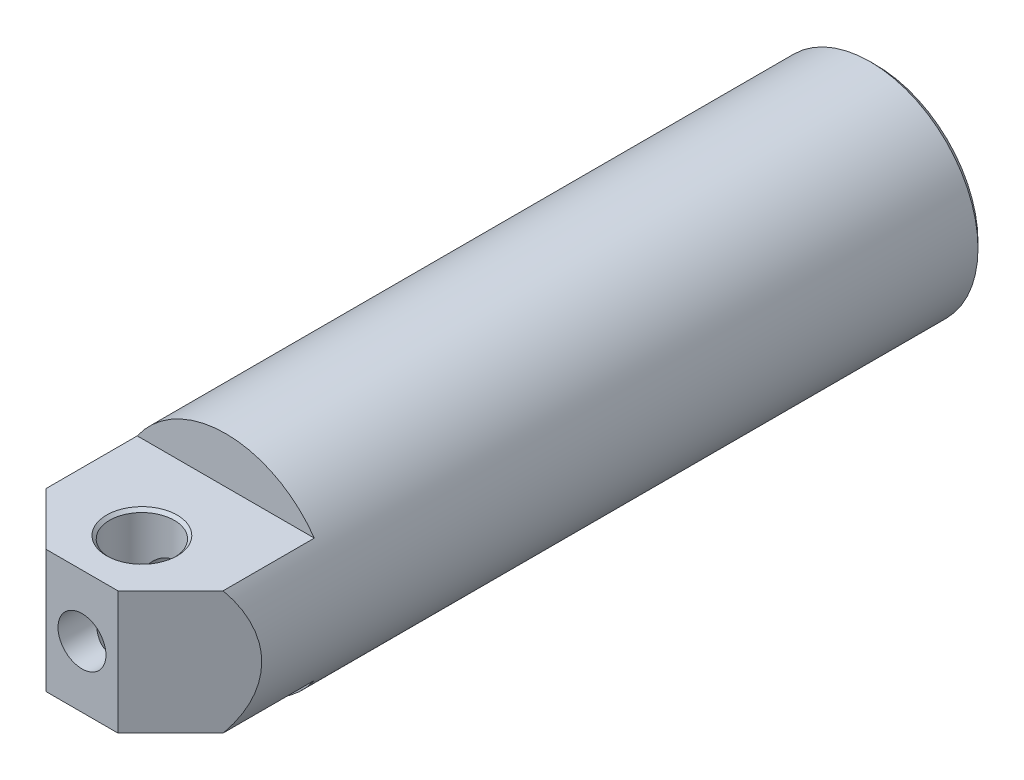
from build123d import *

# Parameters (mm, degrees)
SKETCH2_OUTSIDE_W   = 104.224
SKETCH2_OUTSIDE_H   = 104.224
SKETCH2_OUTSIDE_W_2 = 57.15
SKETCH2_OUTSIDE_H_2 = 32.645999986
CUT_EXTRUDE1_DEPTH  = 38.1
SKETCH3_R           = 8.563500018
CUT_EXTRUDE2_DEPTH  = 218.002307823
CUT_EXTRUDE3_DEPTH  = 218.002307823
CUT_EXTRUDE4_DEPTH  = 215.221151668
CHAMFER1_SIZE       = 1.5875
CHAMFER2_SIZE       = 1.5875
CHAMFER2_SIZE2      = 0.916543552
CHAMFER3_SIZE       = 0.79375
SKETCH6_R           = 6.35
CUT_EXTRUDE5_DEPTH  = 215.221151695
CHAMFER4_SIZE       = 1.5875


with BuildPart() as part:
    # Sketch1 → Revolve1 (revolve)
    with BuildSketch(Plane(origin=(0, 0, 0), x_dir=(0, 0, -1), z_dir=(1, 0, 0)), mode=Mode.PRIVATE) as revolve1_sk:
        Polygon((108.774999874, 22.225), (199.758299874, 22.225), (199.758299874, 22.9489), (200.786999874, 22.9489), (200.786999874, 22.225), (204.786999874, 22.225), (204.786999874, 23.5966), (206.564999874, 23.5966), (206.564999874, 22.225), (210.374999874, 22.225), (210.374999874, 28.575), (0, 28.575), (0, 0), (38.726802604, 0), (44.45, 9.525), (44.45, 19.05), (108.774999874, 19.05), align=None)
    revolve(revolve1_sk.sketch.rotate(Axis((0, 0, 0), (0, 0, -1)), 90), axis=Axis((0, 0, 0), (0, 0, -1)))

    # Sketch2 outside → Cut-Extrude1 (cut)
    with BuildSketch(Plane.XY):
        Rectangle(SKETCH2_OUTSIDE_W, SKETCH2_OUTSIDE_H)
        Rectangle(SKETCH2_OUTSIDE_W_2, SKETCH2_OUTSIDE_H_2, mode=Mode.SUBTRACT)
    extrude(amount=-CUT_EXTRUDE1_DEPTH, mode=Mode.SUBTRACT)

    # Sketch3 → Cut-Extrude2 (cut, through all)
    with BuildSketch(Plane(origin=(0, 16.322999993, 0), x_dir=(1, 0, 0), z_dir=(0, 1, 0))):
        with Locations(Location((0, 15.875, 0), (0, 0, 270))):
            Circle(SKETCH3_R)
    extrude(amount=-CUT_EXTRUDE2_DEPTH, mode=Mode.SUBTRACT)

    # Sketch4 → Cut-Extrude3 (cut, through all)
    with BuildSketch(Plane(origin=(0, 16.322999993, 0), x_dir=(1, 0, 0), z_dir=(0, 1, 0))):
        Polygon((-28.575, 0), (-9.525, 0), (-28.575, 19.05), align=None)
        Polygon((28.575, 19.05), (28.575, 0), (9.525, 0), align=None)
    extrude(amount=-CUT_EXTRUDE3_DEPTH, mode=Mode.SUBTRACT)

    # Sketch5 → Cut-Extrude4 (cut, through all)
    with BuildSketch(Plane(origin=(0, 0, 0), x_dir=(1, 0, 0), z_dir=(0, 1, 0))):
        with BuildLine():
            Line((-4.063500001, 121.474999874), (-4.063500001, 169.099999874))
            ThreePointArc((-4.063500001, 169.099999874), (0, 173.163499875), (4.063500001, 169.099999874))
            Line((4.063500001, 169.099999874), (4.063500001, 121.474999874))
            ThreePointArc((4.063500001, 121.474999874), (0, 117.411499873), (-4.063500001, 121.474999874))
        make_face()
    extrude(amount=-CUT_EXTRUDE4_DEPTH, mode=Mode.SUBTRACT)

    # Chamfer1
    chamfer1_edges = [part.edges().sort_by_distance(p)[0] for p in [
        (-28.575, 0, -210.374999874),
    ]]
    chamfer(chamfer1_edges, length=CHAMFER1_SIZE)

    # Chamfer2
    chamfer2_edges = [part.edges().sort_by_distance(p)[0] for p in [
        (-19.05, 0, -108.774999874),
    ]]
    chamfer2_side = [part.faces().sort_by_distance(p)[0] for p in [
        (-19.05, 0, -76.612499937),
    ]]
    chamfer(chamfer2_edges, length=CHAMFER2_SIZE, length2=CHAMFER2_SIZE2, reference=chamfer2_side[0])

    # Chamfer3
    chamfer3_edges = [part.edges().sort_by_distance(p)[0] for p in [
        (0, -16.322999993, -24.438500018),
        (0, 16.322999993, -24.438500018),
    ]]
    chamfer(chamfer3_edges, length=CHAMFER3_SIZE)

    # Sketch6 → Cut-Extrude5 (cut, through all)
    with BuildSketch(Plane.XY):
        Circle(SKETCH6_R)
    extrude(amount=-CUT_EXTRUDE5_DEPTH, mode=Mode.SUBTRACT)

    # Chamfer4
    chamfer4_edges = [part.edges().sort_by_distance(p)[0] for p in [
        (-22.225, 0, -210.374999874),
    ]]
    chamfer(chamfer4_edges, length=CHAMFER4_SIZE)


solid = part.part
